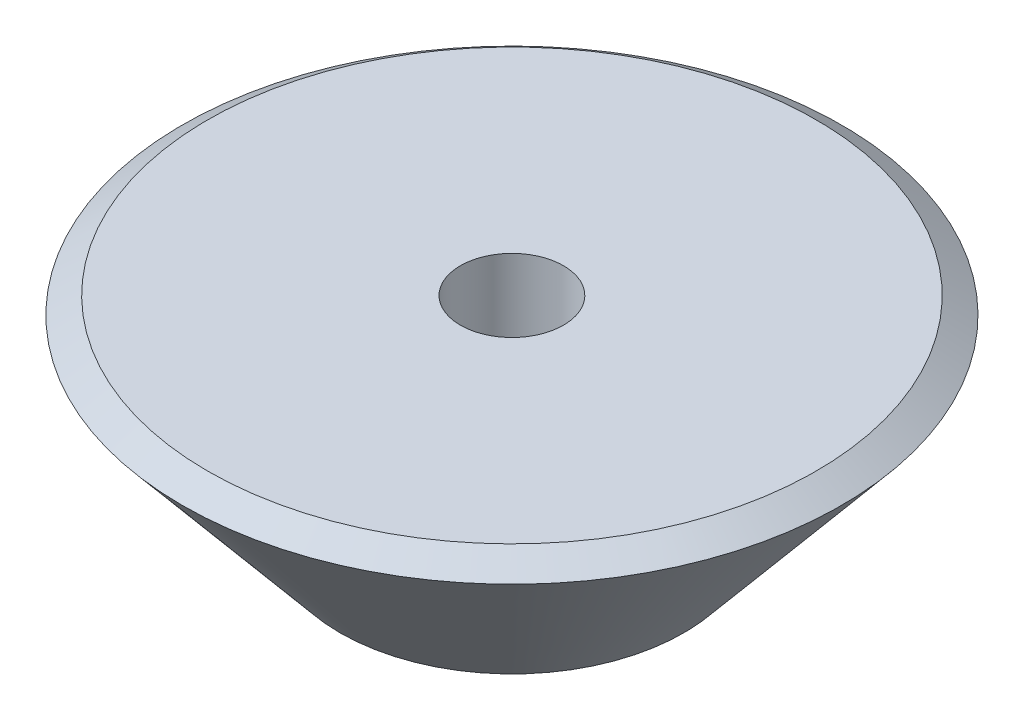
ISO-10303-21;
HEADER;
FILE_DESCRIPTION(('STEP AP214'),'2;1');
FILE_NAME('part.step','',(''),(''),'','','');
FILE_SCHEMA(('AUTOMOTIVE_DESIGN { 1 0 10303 214 1 1 1 1 }'));
ENDSEC;
DATA;
#1=APPLICATION_CONTEXT('core data for automotive mechanical design processes');
#2=APPLICATION_PROTOCOL_DEFINITION('international standard','automotive_design',2000,#1);
#3=PRODUCT_CONTEXT('',#1,'mechanical');
#4=PRODUCT('Part','Part','',(#3));
#5=PRODUCT_RELATED_PRODUCT_CATEGORY('part','',(#4));
#6=PRODUCT_DEFINITION_FORMATION('','',#4);
#7=PRODUCT_DEFINITION_CONTEXT('part definition',#1,'design');
#8=PRODUCT_DEFINITION('design','',#6,#7);
#9=PRODUCT_DEFINITION_SHAPE('','',#8);
#10=(LENGTH_UNIT() NAMED_UNIT(*) SI_UNIT(.MILLI.,.METRE.));
#11=(NAMED_UNIT(*) PLANE_ANGLE_UNIT() SI_UNIT($,.RADIAN.));
#12=(NAMED_UNIT(*) SI_UNIT($,.STERADIAN.) SOLID_ANGLE_UNIT());
#13=UNCERTAINTY_MEASURE_WITH_UNIT(LENGTH_MEASURE(1.E-05),#10,'distance_accuracy_value','');
#14=(GEOMETRIC_REPRESENTATION_CONTEXT(3) GLOBAL_UNCERTAINTY_ASSIGNED_CONTEXT((#13)) GLOBAL_UNIT_ASSIGNED_CONTEXT((#10,
#11,#12)) REPRESENTATION_CONTEXT('',''));
#15=CARTESIAN_POINT('',(0.,0.,0.));
#16=DIRECTION('',(0.,0.,1.));
#17=DIRECTION('',(1.,0.,0.));
#18=AXIS2_PLACEMENT_3D('',#15,#16,#17);
#19=CARTESIAN_POINT('',(0.,8.00000000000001,0.));
#20=DIRECTION('',(0.,1.,0.));
#21=DIRECTION('',(0.,0.,1.));
#22=AXIS2_PLACEMENT_3D('',#19,#20,#21);
#23=PLANE('',#22);
#24=CARTESIAN_POINT('',(0.,8.00000000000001,0.));
#25=DIRECTION('',(0.,1.,0.));
#26=DIRECTION('',(0.,0.,1.));
#27=AXIS2_PLACEMENT_3D('',#24,#25,#26);
#28=CIRCLE('',#27,1.);
#29=CARTESIAN_POINT('',(0.,8.00000000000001,1.));
#30=VERTEX_POINT('',#29);
#31=EDGE_CURVE('E364',#30,#30,#28,.T.);
#32=ORIENTED_EDGE('',*,*,#31,.F.);
#33=EDGE_LOOP('',(#32));
#34=FACE_BOUND('',#33,.T.);
#35=CARTESIAN_POINT('',(0.,8.00000000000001,0.));
#36=DIRECTION('',(0.,1.,0.));
#37=DIRECTION('',(0.,0.,1.));
#38=AXIS2_PLACEMENT_3D('',#35,#36,#37);
#39=CIRCLE('',#38,5.89992248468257);
#40=CARTESIAN_POINT('',(0.,8.00000000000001,5.89992248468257));
#41=VERTEX_POINT('',#40);
#42=EDGE_CURVE('E10',#41,#41,#39,.T.);
#43=ORIENTED_EDGE('',*,*,#42,.T.);
#44=EDGE_LOOP('',(#43));
#45=FACE_BOUND('',#44,.T.);
#46=ADVANCED_FACE('F348',(#34,#45),#23,.T.);
#47=CARTESIAN_POINT('',(0.,8.00000000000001,0.));
#48=DIRECTION('',(0.,-1.,0.));
#49=DIRECTION('',(0.,0.,-1.));
#50=AXIS2_PLACEMENT_3D('',#47,#48,#49);
#51=CONICAL_SURFACE('',#50,5.89992248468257,0.977046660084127);
#52=CARTESIAN_POINT('',(0.,7.66876651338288,0.));
#53=DIRECTION('',(0.,1.,0.));
#54=DIRECTION('',(0.,0.,1.));
#55=AXIS2_PLACEMENT_3D('',#52,#53,#54);
#56=CIRCLE('',#55,6.39063876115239);
#57=CARTESIAN_POINT('',(0.,7.66876651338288,6.39063876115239));
#58=VERTEX_POINT('',#57);
#59=EDGE_CURVE('E355',#58,#58,#56,.T.);
#60=ORIENTED_EDGE('',*,*,#59,.T.);
#61=EDGE_LOOP('',(#60));
#62=FACE_BOUND('',#61,.T.);
#63=ORIENTED_EDGE('',*,*,#42,.F.);
#64=EDGE_LOOP('',(#63));
#65=FACE_BOUND('',#64,.T.);
#66=ADVANCED_FACE('F382',(#62,#65),#51,.T.);
#67=CARTESIAN_POINT('',(0.,7.66876651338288,0.));
#68=DIRECTION('',(0.,1.,0.));
#69=DIRECTION('',(0.,0.,1.));
#70=AXIS2_PLACEMENT_3D('',#67,#68,#69);
#71=CONICAL_SURFACE('',#70,6.39063876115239,0.694738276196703);
#72=CARTESIAN_POINT('',(0.,4.,0.));
#73=DIRECTION('',(0.,1.,0.));
#74=DIRECTION('',(0.,0.,1.));
#75=AXIS2_PLACEMENT_3D('',#72,#73,#74);
#76=CIRCLE('',#75,3.33333333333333);
#77=CARTESIAN_POINT('',(0.,4.,3.33333333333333));
#78=VERTEX_POINT('',#77);
#79=EDGE_CURVE('E359',#78,#78,#76,.T.);
#80=ORIENTED_EDGE('',*,*,#79,.T.);
#81=EDGE_LOOP('',(#80));
#82=FACE_BOUND('',#81,.T.);
#83=ORIENTED_EDGE('',*,*,#59,.F.);
#84=EDGE_LOOP('',(#83));
#85=FACE_BOUND('',#84,.T.);
#86=ADVANCED_FACE('F376',(#82,#85),#71,.T.);
#87=CARTESIAN_POINT('',(0.,4.00000000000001,0.));
#88=DIRECTION('',(0.,-1.,0.));
#89=DIRECTION('',(0.,0.,-1.));
#90=AXIS2_PLACEMENT_3D('',#87,#88,#89);
#91=PLANE('',#90);
#92=CARTESIAN_POINT('',(0.,4.00000000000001,0.));
#93=DIRECTION('',(0.,-1.,0.));
#94=DIRECTION('',(0.,0.,-1.));
#95=AXIS2_PLACEMENT_3D('',#92,#93,#94);
#96=CIRCLE('',#95,1.);
#97=CARTESIAN_POINT('',(0.,4.00000000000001,-1.));
#98=VERTEX_POINT('',#97);
#99=EDGE_CURVE('E351',#98,#98,#96,.T.);
#100=ORIENTED_EDGE('',*,*,#99,.F.);
#101=EDGE_LOOP('',(#100));
#102=FACE_BOUND('',#101,.T.);
#103=ORIENTED_EDGE('',*,*,#79,.F.);
#104=EDGE_LOOP('',(#103));
#105=FACE_BOUND('',#104,.T.);
#106=ADVANCED_FACE('F373',(#102,#105),#91,.T.);
#107=CARTESIAN_POINT('',(0.,-1.99999999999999,0.));
#108=DIRECTION('',(0.,1.,0.));
#109=DIRECTION('',(0.,0.,1.));
#110=AXIS2_PLACEMENT_3D('',#107,#108,#109);
#111=CYLINDRICAL_SURFACE('',#110,1.);
#112=ORIENTED_EDGE('',*,*,#99,.T.);
#113=EDGE_LOOP('',(#112));
#114=FACE_BOUND('',#113,.T.);
#115=ORIENTED_EDGE('',*,*,#31,.T.);
#116=EDGE_LOOP('',(#115));
#117=FACE_BOUND('',#116,.T.);
#118=ADVANCED_FACE('F371',(#114,#117),#111,.F.);
#119=CLOSED_SHELL('',(#46,#66,#86,#106,#118));
#120=MANIFOLD_SOLID_BREP('B2',#119);
#121=ADVANCED_BREP_SHAPE_REPRESENTATION('',(#18,#120),#14);
#122=SHAPE_DEFINITION_REPRESENTATION(#9,#121);
ENDSEC;
END-ISO-10303-21;
